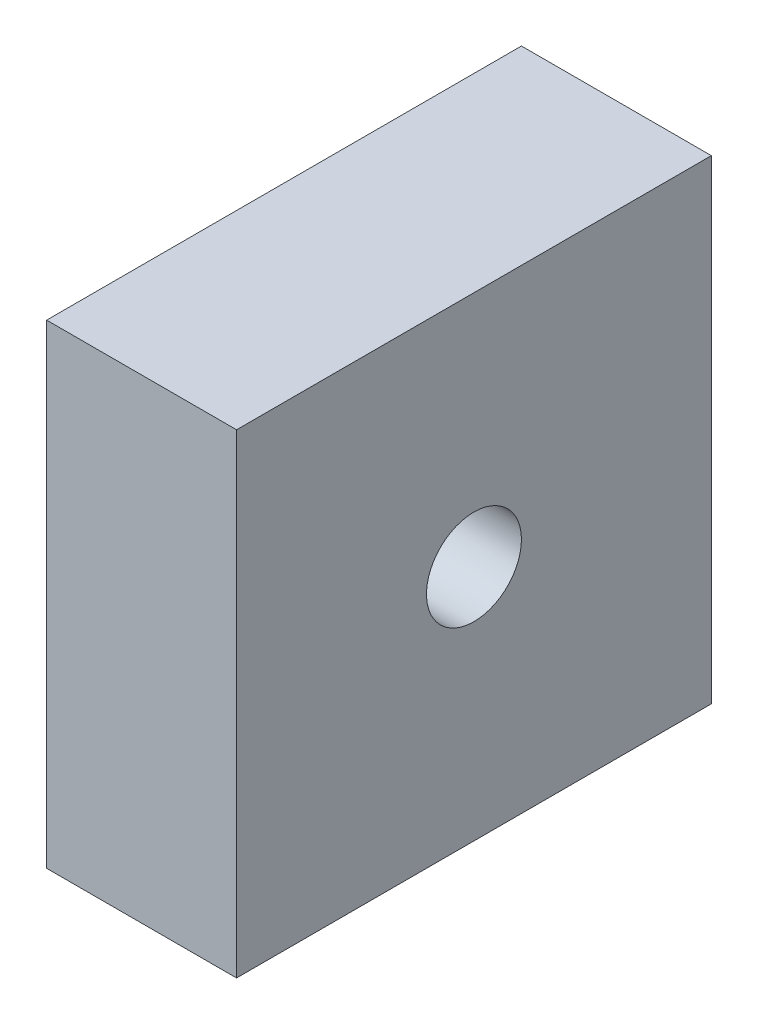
ISO-10303-21;
HEADER;
FILE_DESCRIPTION(('STEP AP214'),'2;1');
FILE_NAME('part.step','',(''),(''),'','','');
FILE_SCHEMA(('AUTOMOTIVE_DESIGN { 1 0 10303 214 1 1 1 1 }'));
ENDSEC;
DATA;
#1=APPLICATION_CONTEXT('core data for automotive mechanical design processes');
#2=APPLICATION_PROTOCOL_DEFINITION('international standard','automotive_design',2000,#1);
#3=PRODUCT_CONTEXT('',#1,'mechanical');
#4=PRODUCT('Part','Part','',(#3));
#5=PRODUCT_RELATED_PRODUCT_CATEGORY('part','',(#4));
#6=PRODUCT_DEFINITION_FORMATION('','',#4);
#7=PRODUCT_DEFINITION_CONTEXT('part definition',#1,'design');
#8=PRODUCT_DEFINITION('design','',#6,#7);
#9=PRODUCT_DEFINITION_SHAPE('','',#8);
#10=(LENGTH_UNIT() NAMED_UNIT(*) SI_UNIT(.MILLI.,.METRE.));
#11=(NAMED_UNIT(*) PLANE_ANGLE_UNIT() SI_UNIT($,.RADIAN.));
#12=(NAMED_UNIT(*) SI_UNIT($,.STERADIAN.) SOLID_ANGLE_UNIT());
#13=UNCERTAINTY_MEASURE_WITH_UNIT(LENGTH_MEASURE(1.E-05),#10,'distance_accuracy_value','');
#14=(GEOMETRIC_REPRESENTATION_CONTEXT(3) GLOBAL_UNCERTAINTY_ASSIGNED_CONTEXT((#13)) GLOBAL_UNIT_ASSIGNED_CONTEXT((#10,
#11,#12)) REPRESENTATION_CONTEXT('',''));
#15=CARTESIAN_POINT('',(0.,0.,0.));
#16=DIRECTION('',(0.,0.,1.));
#17=DIRECTION('',(1.,0.,0.));
#18=AXIS2_PLACEMENT_3D('',#15,#16,#17);
#19=CARTESIAN_POINT('',(20.,0.,0.));
#20=DIRECTION('',(-1.,0.,0.));
#21=DIRECTION('',(0.,0.,1.));
#22=AXIS2_PLACEMENT_3D('',#19,#20,#21);
#23=PLANE('',#22);
#24=DIRECTION('',(0.,-1.,0.));
#25=VECTOR('',#24,1.);
#26=CARTESIAN_POINT('',(20.,0.,0.));
#27=LINE('',#26,#25);
#28=CARTESIAN_POINT('',(20.,50.,0.));
#29=VERTEX_POINT('',#28);
#30=CARTESIAN_POINT('',(20.,0.,0.));
#31=VERTEX_POINT('',#30);
#32=EDGE_CURVE('E86',#29,#31,#27,.T.);
#33=ORIENTED_EDGE('',*,*,#32,.T.);
#34=DIRECTION('',(0.,0.,-1.));
#35=VECTOR('',#34,1.);
#36=CARTESIAN_POINT('',(20.,0.,0.));
#37=LINE('',#36,#35);
#38=CARTESIAN_POINT('',(20.,0.,-50.));
#39=VERTEX_POINT('',#38);
#40=EDGE_CURVE('E81',#31,#39,#37,.T.);
#41=ORIENTED_EDGE('',*,*,#40,.T.);
#42=DIRECTION('',(0.,1.,0.));
#43=VECTOR('',#42,1.);
#44=CARTESIAN_POINT('',(20.,0.,-50.));
#45=LINE('',#44,#43);
#46=CARTESIAN_POINT('',(20.,50.,-50.));
#47=VERTEX_POINT('',#46);
#48=EDGE_CURVE('E84',#39,#47,#45,.T.);
#49=ORIENTED_EDGE('',*,*,#48,.T.);
#50=DIRECTION('',(0.,0.,1.));
#51=VECTOR('',#50,1.);
#52=CARTESIAN_POINT('',(20.,50.,0.));
#53=LINE('',#52,#51);
#54=EDGE_CURVE('E51',#47,#29,#53,.T.);
#55=ORIENTED_EDGE('',*,*,#54,.T.);
#56=EDGE_LOOP('',(#33,#41,#49,#55));
#57=FACE_BOUND('',#56,.T.);
#58=CARTESIAN_POINT('',(20.,25.,-25.));
#59=DIRECTION('',(1.,0.,0.));
#60=DIRECTION('',(0.,0.,-1.));
#61=AXIS2_PLACEMENT_3D('',#58,#59,#60);
#62=CIRCLE('',#61,5.);
#63=CARTESIAN_POINT('',(20.,25.,-30.));
#64=VERTEX_POINT('',#63);
#65=EDGE_CURVE('E101',#64,#64,#62,.T.);
#66=ORIENTED_EDGE('',*,*,#65,.F.);
#67=EDGE_LOOP('',(#66));
#68=FACE_BOUND('',#67,.T.);
#69=ADVANCED_FACE('F34',(#57,#68),#23,.F.);
#70=CARTESIAN_POINT('',(0.,0.,0.));
#71=DIRECTION('',(-1.,0.,0.));
#72=DIRECTION('',(0.,0.,1.));
#73=AXIS2_PLACEMENT_3D('',#70,#71,#72);
#74=PLANE('',#73);
#75=DIRECTION('',(0.,-1.,0.));
#76=VECTOR('',#75,1.);
#77=CARTESIAN_POINT('',(0.,0.,0.));
#78=LINE('',#77,#76);
#79=CARTESIAN_POINT('',(0.,50.,0.));
#80=VERTEX_POINT('',#79);
#81=CARTESIAN_POINT('',(0.,0.,0.));
#82=VERTEX_POINT('',#81);
#83=EDGE_CURVE('E98',#80,#82,#78,.T.);
#84=ORIENTED_EDGE('',*,*,#83,.F.);
#85=DIRECTION('',(0.,0.,1.));
#86=VECTOR('',#85,1.);
#87=CARTESIAN_POINT('',(0.,50.,0.));
#88=LINE('',#87,#86);
#89=CARTESIAN_POINT('',(0.,50.,-50.));
#90=VERTEX_POINT('',#89);
#91=EDGE_CURVE('E74',#90,#80,#88,.T.);
#92=ORIENTED_EDGE('',*,*,#91,.F.);
#93=DIRECTION('',(0.,1.,0.));
#94=VECTOR('',#93,1.);
#95=CARTESIAN_POINT('',(0.,0.,-50.));
#96=LINE('',#95,#94);
#97=CARTESIAN_POINT('',(0.,0.,-50.));
#98=VERTEX_POINT('',#97);
#99=EDGE_CURVE('E68',#98,#90,#96,.T.);
#100=ORIENTED_EDGE('',*,*,#99,.F.);
#101=DIRECTION('',(0.,0.,-1.));
#102=VECTOR('',#101,1.);
#103=CARTESIAN_POINT('',(0.,0.,0.));
#104=LINE('',#103,#102);
#105=EDGE_CURVE('E90',#82,#98,#104,.T.);
#106=ORIENTED_EDGE('',*,*,#105,.F.);
#107=EDGE_LOOP('',(#84,#92,#100,#106));
#108=FACE_BOUND('',#107,.T.);
#109=CARTESIAN_POINT('',(0.,25.,-25.));
#110=DIRECTION('',(1.,0.,0.));
#111=DIRECTION('',(0.,0.,-1.));
#112=AXIS2_PLACEMENT_3D('',#109,#110,#111);
#113=CIRCLE('',#112,5.);
#114=CARTESIAN_POINT('',(0.,25.,-30.));
#115=VERTEX_POINT('',#114);
#116=EDGE_CURVE('E113',#115,#115,#113,.T.);
#117=ORIENTED_EDGE('',*,*,#116,.T.);
#118=EDGE_LOOP('',(#117));
#119=FACE_BOUND('',#118,.T.);
#120=ADVANCED_FACE('F109',(#108,#119),#74,.T.);
#121=CARTESIAN_POINT('',(20.,0.,0.));
#122=DIRECTION('',(0.,0.,-1.));
#123=DIRECTION('',(-1.,0.,0.));
#124=AXIS2_PLACEMENT_3D('',#121,#122,#123);
#125=PLANE('',#124);
#126=ORIENTED_EDGE('',*,*,#83,.T.);
#127=DIRECTION('',(-1.,0.,0.));
#128=VECTOR('',#127,1.);
#129=CARTESIAN_POINT('',(20.,0.,0.));
#130=LINE('',#129,#128);
#131=EDGE_CURVE('E11',#31,#82,#130,.T.);
#132=ORIENTED_EDGE('',*,*,#131,.F.);
#133=ORIENTED_EDGE('',*,*,#32,.F.);
#134=DIRECTION('',(-1.,0.,0.));
#135=VECTOR('',#134,1.);
#136=CARTESIAN_POINT('',(20.,50.,0.));
#137=LINE('',#136,#135);
#138=EDGE_CURVE('E94',#29,#80,#137,.T.);
#139=ORIENTED_EDGE('',*,*,#138,.T.);
#140=EDGE_LOOP('',(#126,#132,#133,#139));
#141=FACE_BOUND('',#140,.T.);
#142=ADVANCED_FACE('F36',(#141),#125,.F.);
#143=CARTESIAN_POINT('',(20.,0.,0.));
#144=DIRECTION('',(0.,1.,0.));
#145=DIRECTION('',(0.,0.,1.));
#146=AXIS2_PLACEMENT_3D('',#143,#144,#145);
#147=PLANE('',#146);
#148=ORIENTED_EDGE('',*,*,#105,.T.);
#149=DIRECTION('',(-1.,0.,0.));
#150=VECTOR('',#149,1.);
#151=CARTESIAN_POINT('',(20.,0.,-50.));
#152=LINE('',#151,#150);
#153=EDGE_CURVE('E43',#39,#98,#152,.T.);
#154=ORIENTED_EDGE('',*,*,#153,.F.);
#155=ORIENTED_EDGE('',*,*,#40,.F.);
#156=ORIENTED_EDGE('',*,*,#131,.T.);
#157=EDGE_LOOP('',(#148,#154,#155,#156));
#158=FACE_BOUND('',#157,.T.);
#159=ADVANCED_FACE('F89',(#158),#147,.F.);
#160=CARTESIAN_POINT('',(20.,0.,-50.));
#161=DIRECTION('',(0.,0.,1.));
#162=DIRECTION('',(1.,0.,0.));
#163=AXIS2_PLACEMENT_3D('',#160,#161,#162);
#164=PLANE('',#163);
#165=ORIENTED_EDGE('',*,*,#99,.T.);
#166=DIRECTION('',(-1.,0.,0.));
#167=VECTOR('',#166,1.);
#168=CARTESIAN_POINT('',(20.,50.,-50.));
#169=LINE('',#168,#167);
#170=EDGE_CURVE('E91',#47,#90,#169,.T.);
#171=ORIENTED_EDGE('',*,*,#170,.F.);
#172=ORIENTED_EDGE('',*,*,#48,.F.);
#173=ORIENTED_EDGE('',*,*,#153,.T.);
#174=EDGE_LOOP('',(#165,#171,#172,#173));
#175=FACE_BOUND('',#174,.T.);
#176=ADVANCED_FACE('F92',(#175),#164,.F.);
#177=CARTESIAN_POINT('',(20.,50.,0.));
#178=DIRECTION('',(0.,-1.,0.));
#179=DIRECTION('',(0.,0.,-1.));
#180=AXIS2_PLACEMENT_3D('',#177,#178,#179);
#181=PLANE('',#180);
#182=ORIENTED_EDGE('',*,*,#91,.T.);
#183=ORIENTED_EDGE('',*,*,#138,.F.);
#184=ORIENTED_EDGE('',*,*,#54,.F.);
#185=ORIENTED_EDGE('',*,*,#170,.T.);
#186=EDGE_LOOP('',(#182,#183,#184,#185));
#187=FACE_BOUND('',#186,.T.);
#188=ADVANCED_FACE('F106',(#187),#181,.F.);
#189=CARTESIAN_POINT('',(20.,25.,-25.));
#190=DIRECTION('',(-1.,0.,0.));
#191=DIRECTION('',(0.,0.,1.));
#192=AXIS2_PLACEMENT_3D('',#189,#190,#191);
#193=CYLINDRICAL_SURFACE('',#192,5.);
#194=ORIENTED_EDGE('',*,*,#65,.T.);
#195=EDGE_LOOP('',(#194));
#196=FACE_BOUND('',#195,.T.);
#197=ORIENTED_EDGE('',*,*,#116,.F.);
#198=EDGE_LOOP('',(#197));
#199=FACE_BOUND('',#198,.T.);
#200=ADVANCED_FACE('F119',(#196,#199),#193,.F.);
#201=CLOSED_SHELL('',(#69,#120,#142,#159,#176,#188,#200));
#202=MANIFOLD_SOLID_BREP('B2',#201);
#203=ADVANCED_BREP_SHAPE_REPRESENTATION('',(#18,#202),#14);
#204=SHAPE_DEFINITION_REPRESENTATION(#9,#203);
ENDSEC;
END-ISO-10303-21;
